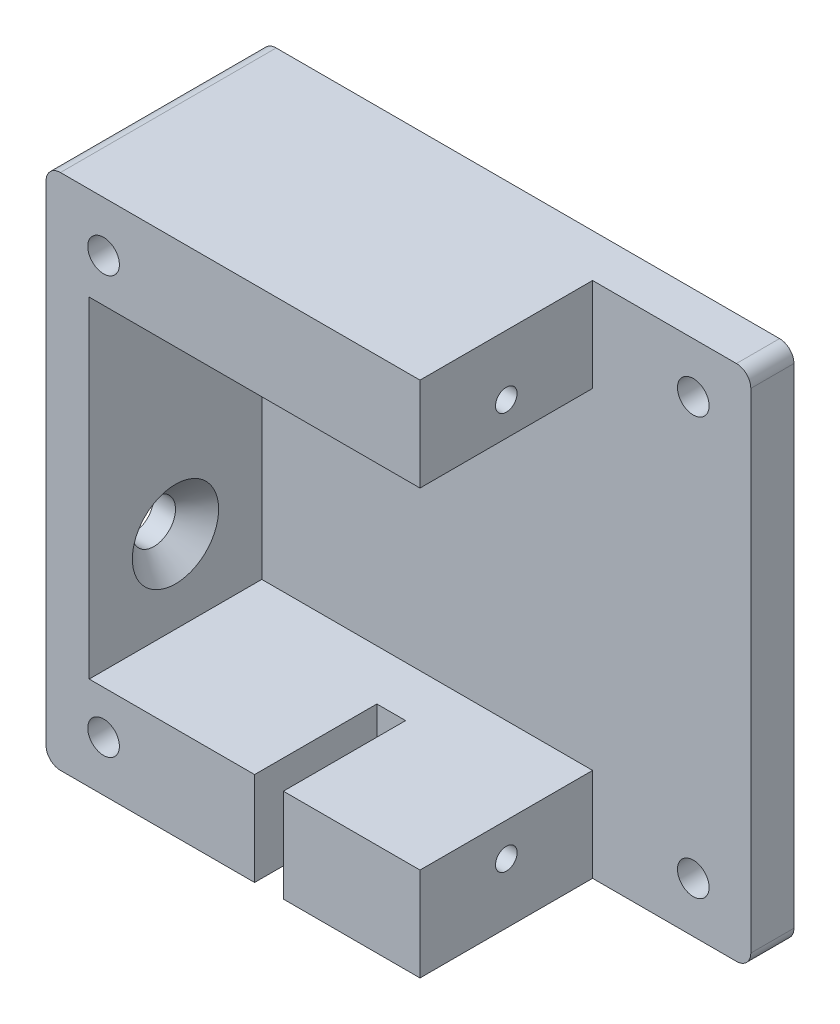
ISO-10303-21;
HEADER;
FILE_DESCRIPTION(('STEP AP214'),'2;1');
FILE_NAME('part.step','',(''),(''),'','','');
FILE_SCHEMA(('AUTOMOTIVE_DESIGN { 1 0 10303 214 1 1 1 1 }'));
ENDSEC;
DATA;
#1=APPLICATION_CONTEXT('core data for automotive mechanical design processes');
#2=APPLICATION_PROTOCOL_DEFINITION('international standard','automotive_design',2000,#1);
#3=PRODUCT_CONTEXT('',#1,'mechanical');
#4=PRODUCT('Part','Part','',(#3));
#5=PRODUCT_RELATED_PRODUCT_CATEGORY('part','',(#4));
#6=PRODUCT_DEFINITION_FORMATION('','',#4);
#7=PRODUCT_DEFINITION_CONTEXT('part definition',#1,'design');
#8=PRODUCT_DEFINITION('design','',#6,#7);
#9=PRODUCT_DEFINITION_SHAPE('','',#8);
#10=(LENGTH_UNIT() NAMED_UNIT(*) SI_UNIT(.MILLI.,.METRE.));
#11=(NAMED_UNIT(*) PLANE_ANGLE_UNIT() SI_UNIT($,.RADIAN.));
#12=(NAMED_UNIT(*) SI_UNIT($,.STERADIAN.) SOLID_ANGLE_UNIT());
#13=UNCERTAINTY_MEASURE_WITH_UNIT(LENGTH_MEASURE(1.E-05),#10,'distance_accuracy_value','');
#14=(GEOMETRIC_REPRESENTATION_CONTEXT(3) GLOBAL_UNCERTAINTY_ASSIGNED_CONTEXT((#13)) GLOBAL_UNIT_ASSIGNED_CONTEXT((#10,
#11,#12)) REPRESENTATION_CONTEXT('',''));
#15=CARTESIAN_POINT('',(0.,0.,0.));
#16=DIRECTION('',(0.,0.,1.));
#17=DIRECTION('',(1.,0.,0.));
#18=AXIS2_PLACEMENT_3D('',#15,#16,#17);
#19=CARTESIAN_POINT('',(0.,0.,15.));
#20=DIRECTION('',(0.,0.,1.));
#21=DIRECTION('',(1.,0.,0.));
#22=AXIS2_PLACEMENT_3D('',#19,#20,#21);
#23=PLANE('',#22);
#24=CARTESIAN_POINT('',(-14.5,14.5,15.));
#25=DIRECTION('',(0.,0.,-1.));
#26=DIRECTION('',(-1.,0.,0.));
#27=AXIS2_PLACEMENT_3D('',#24,#25,#26);
#28=CIRCLE('',#27,1.1);
#29=CARTESIAN_POINT('',(-15.6,14.5,15.));
#30=VERTEX_POINT('',#29);
#31=EDGE_CURVE('E402',#30,#30,#28,.T.);
#32=ORIENTED_EDGE('',*,*,#31,.T.);
#33=EDGE_LOOP('',(#32));
#34=FACE_BOUND('',#33,.T.);
#35=CARTESIAN_POINT('',(-14.5,-14.5,15.));
#36=DIRECTION('',(0.,0.,-1.));
#37=DIRECTION('',(-1.,0.,0.));
#38=AXIS2_PLACEMENT_3D('',#35,#36,#37);
#39=CIRCLE('',#38,1.1);
#40=CARTESIAN_POINT('',(-15.6,-14.5,15.));
#41=VERTEX_POINT('',#40);
#42=EDGE_CURVE('E409',#41,#41,#39,.T.);
#43=ORIENTED_EDGE('',*,*,#42,.T.);
#44=EDGE_LOOP('',(#43));
#45=FACE_BOUND('',#44,.T.);
#46=DIRECTION('',(0.,-1.,0.));
#47=VECTOR('',#46,1.);
#48=CARTESIAN_POINT('',(-18.5,18.,15.));
#49=LINE('',#48,#47);
#50=CARTESIAN_POINT('',(-18.5,17.,15.));
#51=VERTEX_POINT('',#50);
#52=CARTESIAN_POINT('',(-18.5,-17.,15.));
#53=VERTEX_POINT('',#52);
#54=EDGE_CURVE('E218',#51,#53,#49,.T.);
#55=ORIENTED_EDGE('',*,*,#54,.T.);
#56=CARTESIAN_POINT('',(-17.5,-17.,15.));
#57=DIRECTION('',(0.,0.,1.));
#58=DIRECTION('',(1.,0.,0.));
#59=AXIS2_PLACEMENT_3D('',#56,#57,#58);
#60=CIRCLE('',#59,1.);
#61=CARTESIAN_POINT('',(-17.5,-18.,15.));
#62=VERTEX_POINT('',#61);
#63=EDGE_CURVE('E11',#53,#62,#60,.T.);
#64=ORIENTED_EDGE('',*,*,#63,.T.);
#65=DIRECTION('',(1.,0.,0.));
#66=VECTOR('',#65,1.);
#67=CARTESIAN_POINT('',(-18.5,-18.,15.));
#68=LINE('',#67,#66);
#69=CARTESIAN_POINT('',(-4.,-18.,15.));
#70=VERTEX_POINT('',#69);
#71=EDGE_CURVE('E221',#62,#70,#68,.T.);
#72=ORIENTED_EDGE('',*,*,#71,.T.);
#73=DIRECTION('',(0.,-1.,0.));
#74=VECTOR('',#73,1.);
#75=CARTESIAN_POINT('',(-4.,-2.76787540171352,15.));
#76=LINE('',#75,#74);
#77=CARTESIAN_POINT('',(-4.,-11.5,15.));
#78=VERTEX_POINT('',#77);
#79=EDGE_CURVE('E178',#78,#70,#76,.T.);
#80=ORIENTED_EDGE('',*,*,#79,.F.);
#81=DIRECTION('',(-1.,0.,0.));
#82=VECTOR('',#81,1.);
#83=CARTESIAN_POINT('',(7.5,-11.5,15.));
#84=LINE('',#83,#82);
#85=CARTESIAN_POINT('',(-15.5,-11.5,15.));
#86=VERTEX_POINT('',#85);
#87=EDGE_CURVE('E225',#78,#86,#84,.T.);
#88=ORIENTED_EDGE('',*,*,#87,.T.);
#89=DIRECTION('',(0.,1.,0.));
#90=VECTOR('',#89,1.);
#91=CARTESIAN_POINT('',(-15.5,11.5,15.));
#92=LINE('',#91,#90);
#93=CARTESIAN_POINT('',(-15.5,11.5,15.));
#94=VERTEX_POINT('',#93);
#95=EDGE_CURVE('E229',#86,#94,#92,.T.);
#96=ORIENTED_EDGE('',*,*,#95,.T.);
#97=DIRECTION('',(1.,0.,0.));
#98=VECTOR('',#97,1.);
#99=CARTESIAN_POINT('',(-8.8,11.5,15.));
#100=LINE('',#99,#98);
#101=CARTESIAN_POINT('',(7.5,11.5,15.));
#102=VERTEX_POINT('',#101);
#103=EDGE_CURVE('E231',#94,#102,#100,.T.);
#104=ORIENTED_EDGE('',*,*,#103,.T.);
#105=DIRECTION('',(0.,1.,0.));
#106=VECTOR('',#105,1.);
#107=CARTESIAN_POINT('',(7.5,11.5,15.));
#108=LINE('',#107,#106);
#109=CARTESIAN_POINT('',(7.5,18.,15.));
#110=VERTEX_POINT('',#109);
#111=EDGE_CURVE('E212',#102,#110,#108,.T.);
#112=ORIENTED_EDGE('',*,*,#111,.T.);
#113=DIRECTION('',(-1.,0.,0.));
#114=VECTOR('',#113,1.);
#115=CARTESIAN_POINT('',(7.5,18.,15.));
#116=LINE('',#115,#114);
#117=CARTESIAN_POINT('',(-17.5,18.,15.));
#118=VERTEX_POINT('',#117);
#119=EDGE_CURVE('E215',#110,#118,#116,.T.);
#120=ORIENTED_EDGE('',*,*,#119,.T.);
#121=CARTESIAN_POINT('',(-17.5,17.,15.));
#122=DIRECTION('',(0.,0.,1.));
#123=DIRECTION('',(1.,0.,0.));
#124=AXIS2_PLACEMENT_3D('',#121,#122,#123);
#125=CIRCLE('',#124,1.);
#126=EDGE_CURVE('E42',#118,#51,#125,.T.);
#127=ORIENTED_EDGE('',*,*,#126,.T.);
#128=EDGE_LOOP('',(#55,#64,#72,#80,#88,#96,#104,#112,#120,#127));
#129=FACE_BOUND('',#128,.T.);
#130=ADVANCED_FACE('F34',(#34,#45,#129),#23,.T.);
#131=CARTESIAN_POINT('',(0.,0.,3.));
#132=DIRECTION('',(0.,0.,-1.));
#133=DIRECTION('',(-1.,0.,0.));
#134=AXIS2_PLACEMENT_3D('',#131,#132,#133);
#135=PLANE('',#134);
#136=CARTESIAN_POINT('',(14.5,-14.5,3.));
#137=DIRECTION('',(0.,0.,-1.));
#138=DIRECTION('',(-1.,0.,0.));
#139=AXIS2_PLACEMENT_3D('',#136,#137,#138);
#140=CIRCLE('',#139,1.1);
#141=CARTESIAN_POINT('',(13.4,-14.5,3.));
#142=VERTEX_POINT('',#141);
#143=EDGE_CURVE('E399',#142,#142,#140,.T.);
#144=ORIENTED_EDGE('',*,*,#143,.T.);
#145=EDGE_LOOP('',(#144));
#146=FACE_BOUND('',#145,.T.);
#147=CARTESIAN_POINT('',(14.5,14.5,3.));
#148=DIRECTION('',(0.,0.,-1.));
#149=DIRECTION('',(-1.,0.,0.));
#150=AXIS2_PLACEMENT_3D('',#147,#148,#149);
#151=CIRCLE('',#150,1.1);
#152=CARTESIAN_POINT('',(13.4,14.5,3.));
#153=VERTEX_POINT('',#152);
#154=EDGE_CURVE('E181',#153,#153,#151,.T.);
#155=ORIENTED_EDGE('',*,*,#154,.T.);
#156=EDGE_LOOP('',(#155));
#157=FACE_BOUND('',#156,.T.);
#158=DIRECTION('',(0.,1.,0.));
#159=VECTOR('',#158,1.);
#160=CARTESIAN_POINT('',(18.5,-18.,3.));
#161=LINE('',#160,#159);
#162=CARTESIAN_POINT('',(18.5,-17.,3.));
#163=VERTEX_POINT('',#162);
#164=CARTESIAN_POINT('',(18.5,17.,3.));
#165=VERTEX_POINT('',#164);
#166=EDGE_CURVE('E265',#163,#165,#161,.T.);
#167=ORIENTED_EDGE('',*,*,#166,.T.);
#168=CARTESIAN_POINT('',(17.5,17.,3.));
#169=DIRECTION('',(0.,0.,-1.));
#170=DIRECTION('',(-1.,0.,0.));
#171=AXIS2_PLACEMENT_3D('',#168,#169,#170);
#172=CIRCLE('',#171,1.);
#173=CARTESIAN_POINT('',(17.5,18.,3.));
#174=VERTEX_POINT('',#173);
#175=EDGE_CURVE('E310',#165,#174,#172,.F.);
#176=ORIENTED_EDGE('',*,*,#175,.T.);
#177=DIRECTION('',(-1.,0.,0.));
#178=VECTOR('',#177,1.);
#179=CARTESIAN_POINT('',(-18.5,18.,3.));
#180=LINE('',#179,#178);
#181=CARTESIAN_POINT('',(7.5,18.,3.));
#182=VERTEX_POINT('',#181);
#183=EDGE_CURVE('E268',#174,#182,#180,.T.);
#184=ORIENTED_EDGE('',*,*,#183,.T.);
#185=DIRECTION('',(0.,1.,0.));
#186=VECTOR('',#185,1.);
#187=CARTESIAN_POINT('',(7.5,11.5,3.));
#188=LINE('',#187,#186);
#189=CARTESIAN_POINT('',(7.5,11.5,3.));
#190=VERTEX_POINT('',#189);
#191=EDGE_CURVE('E211',#190,#182,#188,.T.);
#192=ORIENTED_EDGE('',*,*,#191,.F.);
#193=DIRECTION('',(1.,0.,0.));
#194=VECTOR('',#193,1.);
#195=CARTESIAN_POINT('',(-8.8,11.5,3.));
#196=LINE('',#195,#194);
#197=CARTESIAN_POINT('',(-15.5,11.5,3.));
#198=VERTEX_POINT('',#197);
#199=EDGE_CURVE('E216',#198,#190,#196,.T.);
#200=ORIENTED_EDGE('',*,*,#199,.F.);
#201=DIRECTION('',(0.,1.,0.));
#202=VECTOR('',#201,1.);
#203=CARTESIAN_POINT('',(-15.5,11.5,3.));
#204=LINE('',#203,#202);
#205=CARTESIAN_POINT('',(-15.5,-11.5,3.));
#206=VERTEX_POINT('',#205);
#207=EDGE_CURVE('E242',#206,#198,#204,.T.);
#208=ORIENTED_EDGE('',*,*,#207,.F.);
#209=DIRECTION('',(-1.,0.,0.));
#210=VECTOR('',#209,1.);
#211=CARTESIAN_POINT('',(-15.5,-11.5,3.));
#212=LINE('',#211,#210);
#213=CARTESIAN_POINT('',(7.5,-11.5,3.));
#214=VERTEX_POINT('',#213);
#215=EDGE_CURVE('E239',#214,#206,#212,.T.);
#216=ORIENTED_EDGE('',*,*,#215,.F.);
#217=DIRECTION('',(0.,1.,0.));
#218=VECTOR('',#217,1.);
#219=CARTESIAN_POINT('',(7.5,-18.,3.));
#220=LINE('',#219,#218);
#221=CARTESIAN_POINT('',(7.5,-18.,3.));
#222=VERTEX_POINT('',#221);
#223=EDGE_CURVE('E236',#222,#214,#220,.T.);
#224=ORIENTED_EDGE('',*,*,#223,.F.);
#225=DIRECTION('',(1.,0.,0.));
#226=VECTOR('',#225,1.);
#227=CARTESIAN_POINT('',(-18.5,-18.,3.));
#228=LINE('',#227,#226);
#229=CARTESIAN_POINT('',(17.5,-18.,3.));
#230=VERTEX_POINT('',#229);
#231=EDGE_CURVE('E271',#222,#230,#228,.T.);
#232=ORIENTED_EDGE('',*,*,#231,.T.);
#233=CARTESIAN_POINT('',(17.5,-17.,3.));
#234=DIRECTION('',(0.,0.,-1.));
#235=DIRECTION('',(-1.,0.,0.));
#236=AXIS2_PLACEMENT_3D('',#233,#234,#235);
#237=CIRCLE('',#236,1.);
#238=EDGE_CURVE('E308',#230,#163,#237,.F.);
#239=ORIENTED_EDGE('',*,*,#238,.T.);
#240=EDGE_LOOP('',(#167,#176,#184,#192,#200,#208,#216,#224,#232,#239));
#241=FACE_BOUND('',#240,.T.);
#242=ADVANCED_FACE('F360',(#146,#157,#241),#135,.F.);
#243=CARTESIAN_POINT('',(18.5,-18.,3.));
#244=DIRECTION('',(-1.,0.,0.));
#245=DIRECTION('',(0.,0.,1.));
#246=AXIS2_PLACEMENT_3D('',#243,#244,#245);
#247=PLANE('',#246);
#248=DIRECTION('',(0.,1.,0.));
#249=VECTOR('',#248,1.);
#250=CARTESIAN_POINT('',(18.5,-18.,0.));
#251=LINE('',#250,#249);
#252=CARTESIAN_POINT('',(18.5,-17.,0.));
#253=VERTEX_POINT('',#252);
#254=CARTESIAN_POINT('',(18.5,17.,0.));
#255=VERTEX_POINT('',#254);
#256=EDGE_CURVE('E264',#253,#255,#251,.T.);
#257=ORIENTED_EDGE('',*,*,#256,.T.);
#258=DIRECTION('',(0.,0.,-1.));
#259=VECTOR('',#258,1.);
#260=CARTESIAN_POINT('',(18.5,17.,3.));
#261=LINE('',#260,#259);
#262=EDGE_CURVE('E306',#255,#165,#261,.F.);
#263=ORIENTED_EDGE('',*,*,#262,.T.);
#264=ORIENTED_EDGE('',*,*,#166,.F.);
#265=DIRECTION('',(0.,0.,-1.));
#266=VECTOR('',#265,1.);
#267=CARTESIAN_POINT('',(18.5,-17.,3.));
#268=LINE('',#267,#266);
#269=EDGE_CURVE('E303',#163,#253,#268,.T.);
#270=ORIENTED_EDGE('',*,*,#269,.T.);
#271=EDGE_LOOP('',(#257,#263,#264,#270));
#272=FACE_BOUND('',#271,.T.);
#273=ADVANCED_FACE('F367',(#272),#247,.F.);
#274=CARTESIAN_POINT('',(-18.5,18.,3.));
#275=DIRECTION('',(0.,-1.,0.));
#276=DIRECTION('',(0.,0.,-1.));
#277=AXIS2_PLACEMENT_3D('',#274,#275,#276);
#278=PLANE('',#277);
#279=ORIENTED_EDGE('',*,*,#183,.F.);
#280=DIRECTION('',(0.,0.,-1.));
#281=VECTOR('',#280,1.);
#282=CARTESIAN_POINT('',(17.5,18.,3.));
#283=LINE('',#282,#281);
#284=CARTESIAN_POINT('',(17.5,18.,0.));
#285=VERTEX_POINT('',#284);
#286=EDGE_CURVE('E292',#174,#285,#283,.T.);
#287=ORIENTED_EDGE('',*,*,#286,.T.);
#288=DIRECTION('',(-1.,0.,0.));
#289=VECTOR('',#288,1.);
#290=CARTESIAN_POINT('',(-18.5,18.,0.));
#291=LINE('',#290,#289);
#292=CARTESIAN_POINT('',(-17.5,18.,0.));
#293=VERTEX_POINT('',#292);
#294=EDGE_CURVE('E277',#285,#293,#291,.T.);
#295=ORIENTED_EDGE('',*,*,#294,.T.);
#296=DIRECTION('',(0.,0.,-1.));
#297=VECTOR('',#296,1.);
#298=CARTESIAN_POINT('',(-17.5,18.,3.));
#299=LINE('',#298,#297);
#300=EDGE_CURVE('E288',#293,#118,#299,.F.);
#301=ORIENTED_EDGE('',*,*,#300,.T.);
#302=ORIENTED_EDGE('',*,*,#119,.F.);
#303=DIRECTION('',(0.,0.,-1.));
#304=VECTOR('',#303,1.);
#305=CARTESIAN_POINT('',(7.5,18.,15.));
#306=LINE('',#305,#304);
#307=EDGE_CURVE('E261',#110,#182,#306,.T.);
#308=ORIENTED_EDGE('',*,*,#307,.T.);
#309=EDGE_LOOP('',(#279,#287,#295,#301,#302,#308));
#310=FACE_BOUND('',#309,.T.);
#311=ADVANCED_FACE('F351',(#310),#278,.F.);
#312=CARTESIAN_POINT('',(-18.5,-18.,3.));
#313=DIRECTION('',(1.,0.,0.));
#314=DIRECTION('',(0.,0.,-1.));
#315=AXIS2_PLACEMENT_3D('',#312,#313,#314);
#316=PLANE('',#315);
#317=CARTESIAN_POINT('',(-18.5,-5.77,9.));
#318=DIRECTION('',(1.,0.,0.));
#319=DIRECTION('',(0.,1.,0.));
#320=AXIS2_PLACEMENT_3D('',#317,#318,#319);
#321=CIRCLE('',#320,1.5);
#322=CARTESIAN_POINT('',(-18.5,-4.27,9.));
#323=VERTEX_POINT('',#322);
#324=EDGE_CURVE('E206',#323,#323,#321,.T.);
#325=ORIENTED_EDGE('',*,*,#324,.T.);
#326=EDGE_LOOP('',(#325));
#327=FACE_BOUND('',#326,.T.);
#328=DIRECTION('',(0.,-1.,0.));
#329=VECTOR('',#328,1.);
#330=CARTESIAN_POINT('',(-18.5,-18.,0.));
#331=LINE('',#330,#329);
#332=CARTESIAN_POINT('',(-18.5,17.,0.));
#333=VERTEX_POINT('',#332);
#334=CARTESIAN_POINT('',(-18.5,-17.,0.));
#335=VERTEX_POINT('',#334);
#336=EDGE_CURVE('E280',#333,#335,#331,.T.);
#337=ORIENTED_EDGE('',*,*,#336,.T.);
#338=DIRECTION('',(0.,0.,-1.));
#339=VECTOR('',#338,1.);
#340=CARTESIAN_POINT('',(-18.5,-17.,3.));
#341=LINE('',#340,#339);
#342=EDGE_CURVE('E49',#335,#53,#341,.F.);
#343=ORIENTED_EDGE('',*,*,#342,.T.);
#344=ORIENTED_EDGE('',*,*,#54,.F.);
#345=DIRECTION('',(0.,0.,-1.));
#346=VECTOR('',#345,1.);
#347=CARTESIAN_POINT('',(-18.5,17.,3.));
#348=LINE('',#347,#346);
#349=EDGE_CURVE('E317',#51,#333,#348,.T.);
#350=ORIENTED_EDGE('',*,*,#349,.T.);
#351=EDGE_LOOP('',(#337,#343,#344,#350));
#352=FACE_BOUND('',#351,.T.);
#353=ADVANCED_FACE('F322',(#327,#352),#316,.F.);
#354=CARTESIAN_POINT('',(-18.5,-18.,3.));
#355=DIRECTION('',(0.,1.,0.));
#356=DIRECTION('',(0.,0.,1.));
#357=AXIS2_PLACEMENT_3D('',#354,#355,#356);
#358=PLANE('',#357);
#359=DIRECTION('',(1.,0.,0.));
#360=VECTOR('',#359,1.);
#361=CARTESIAN_POINT('',(-18.5,-18.,0.));
#362=LINE('',#361,#360);
#363=CARTESIAN_POINT('',(-17.5,-18.,0.));
#364=VERTEX_POINT('',#363);
#365=CARTESIAN_POINT('',(17.5,-18.,0.));
#366=VERTEX_POINT('',#365);
#367=EDGE_CURVE('E269',#364,#366,#362,.T.);
#368=ORIENTED_EDGE('',*,*,#367,.T.);
#369=DIRECTION('',(0.,0.,-1.));
#370=VECTOR('',#369,1.);
#371=CARTESIAN_POINT('',(17.5,-18.,3.));
#372=LINE('',#371,#370);
#373=EDGE_CURVE('E315',#366,#230,#372,.F.);
#374=ORIENTED_EDGE('',*,*,#373,.T.);
#375=ORIENTED_EDGE('',*,*,#231,.F.);
#376=DIRECTION('',(0.,0.,-1.));
#377=VECTOR('',#376,1.);
#378=CARTESIAN_POINT('',(7.5,-18.,15.));
#379=LINE('',#378,#377);
#380=CARTESIAN_POINT('',(7.5,-18.,15.));
#381=VERTEX_POINT('',#380);
#382=EDGE_CURVE('E258',#381,#222,#379,.T.);
#383=ORIENTED_EDGE('',*,*,#382,.F.);
#384=CARTESIAN_POINT('',(-2.00000000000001,-18.,15.));
#385=VERTEX_POINT('',#384);
#386=EDGE_CURVE('E220',#385,#381,#68,.T.);
#387=ORIENTED_EDGE('',*,*,#386,.F.);
#388=DIRECTION('',(0.,0.,1.));
#389=VECTOR('',#388,1.);
#390=CARTESIAN_POINT('',(-2.,-18.,15.));
#391=LINE('',#390,#389);
#392=CARTESIAN_POINT('',(-2.,-18.,6.5));
#393=VERTEX_POINT('',#392);
#394=EDGE_CURVE('E171',#393,#385,#391,.T.);
#395=ORIENTED_EDGE('',*,*,#394,.F.);
#396=DIRECTION('',(1.,0.,0.));
#397=VECTOR('',#396,1.);
#398=CARTESIAN_POINT('',(-4.,-18.,6.5));
#399=LINE('',#398,#397);
#400=CARTESIAN_POINT('',(-4.,-18.,6.5));
#401=VERTEX_POINT('',#400);
#402=EDGE_CURVE('E164',#401,#393,#399,.T.);
#403=ORIENTED_EDGE('',*,*,#402,.F.);
#404=DIRECTION('',(0.,0.,-1.));
#405=VECTOR('',#404,1.);
#406=CARTESIAN_POINT('',(-4.,-18.,15.));
#407=LINE('',#406,#405);
#408=EDGE_CURVE('E175',#70,#401,#407,.T.);
#409=ORIENTED_EDGE('',*,*,#408,.F.);
#410=ORIENTED_EDGE('',*,*,#71,.F.);
#411=DIRECTION('',(0.,0.,-1.));
#412=VECTOR('',#411,1.);
#413=CARTESIAN_POINT('',(-17.5,-18.,3.));
#414=LINE('',#413,#412);
#415=EDGE_CURVE('E312',#62,#364,#414,.T.);
#416=ORIENTED_EDGE('',*,*,#415,.T.);
#417=EDGE_LOOP('',(#368,#374,#375,#383,#387,#395,#403,#409,#410,#416));
#418=FACE_BOUND('',#417,.T.);
#419=ADVANCED_FACE('F184',(#418),#358,.F.);
#420=CARTESIAN_POINT('',(0.,0.,0.));
#421=DIRECTION('',(0.,0.,-1.));
#422=DIRECTION('',(-1.,0.,0.));
#423=AXIS2_PLACEMENT_3D('',#420,#421,#422);
#424=PLANE('',#423);
#425=CARTESIAN_POINT('',(-14.5,14.5,0.));
#426=DIRECTION('',(0.,0.,-1.));
#427=DIRECTION('',(-1.,0.,0.));
#428=AXIS2_PLACEMENT_3D('',#425,#426,#427);
#429=CIRCLE('',#428,1.1);
#430=CARTESIAN_POINT('',(-15.6,14.5,0.));
#431=VERTEX_POINT('',#430);
#432=EDGE_CURVE('E412',#431,#431,#429,.T.);
#433=ORIENTED_EDGE('',*,*,#432,.F.);
#434=EDGE_LOOP('',(#433));
#435=FACE_BOUND('',#434,.T.);
#436=CARTESIAN_POINT('',(-14.5,-14.5,0.));
#437=DIRECTION('',(0.,0.,-1.));
#438=DIRECTION('',(-1.,0.,0.));
#439=AXIS2_PLACEMENT_3D('',#436,#437,#438);
#440=CIRCLE('',#439,1.1);
#441=CARTESIAN_POINT('',(-15.6,-14.5,0.));
#442=VERTEX_POINT('',#441);
#443=EDGE_CURVE('E406',#442,#442,#440,.T.);
#444=ORIENTED_EDGE('',*,*,#443,.F.);
#445=EDGE_LOOP('',(#444));
#446=FACE_BOUND('',#445,.T.);
#447=CARTESIAN_POINT('',(14.5,-14.5,0.));
#448=DIRECTION('',(0.,0.,-1.));
#449=DIRECTION('',(-1.,0.,0.));
#450=AXIS2_PLACEMENT_3D('',#447,#448,#449);
#451=CIRCLE('',#450,1.1);
#452=CARTESIAN_POINT('',(13.4,-14.5,0.));
#453=VERTEX_POINT('',#452);
#454=EDGE_CURVE('E403',#453,#453,#451,.T.);
#455=ORIENTED_EDGE('',*,*,#454,.F.);
#456=EDGE_LOOP('',(#455));
#457=FACE_BOUND('',#456,.T.);
#458=CARTESIAN_POINT('',(14.5,14.5,0.));
#459=DIRECTION('',(0.,0.,-1.));
#460=DIRECTION('',(-1.,0.,0.));
#461=AXIS2_PLACEMENT_3D('',#458,#459,#460);
#462=CIRCLE('',#461,1.1);
#463=CARTESIAN_POINT('',(13.4,14.5,0.));
#464=VERTEX_POINT('',#463);
#465=EDGE_CURVE('E396',#464,#464,#462,.T.);
#466=ORIENTED_EDGE('',*,*,#465,.F.);
#467=EDGE_LOOP('',(#466));
#468=FACE_BOUND('',#467,.T.);
#469=ORIENTED_EDGE('',*,*,#294,.F.);
#470=CARTESIAN_POINT('',(17.5,17.,0.));
#471=DIRECTION('',(0.,0.,-1.));
#472=DIRECTION('',(-1.,0.,0.));
#473=AXIS2_PLACEMENT_3D('',#470,#471,#472);
#474=CIRCLE('',#473,1.);
#475=EDGE_CURVE('E301',#285,#255,#474,.T.);
#476=ORIENTED_EDGE('',*,*,#475,.T.);
#477=ORIENTED_EDGE('',*,*,#256,.F.);
#478=CARTESIAN_POINT('',(17.5,-17.,0.));
#479=DIRECTION('',(0.,0.,-1.));
#480=DIRECTION('',(-1.,0.,0.));
#481=AXIS2_PLACEMENT_3D('',#478,#479,#480);
#482=CIRCLE('',#481,1.);
#483=EDGE_CURVE('E299',#253,#366,#482,.T.);
#484=ORIENTED_EDGE('',*,*,#483,.T.);
#485=ORIENTED_EDGE('',*,*,#367,.F.);
#486=CARTESIAN_POINT('',(-17.5,-17.,0.));
#487=DIRECTION('',(0.,0.,-1.));
#488=DIRECTION('',(-1.,0.,0.));
#489=AXIS2_PLACEMENT_3D('',#486,#487,#488);
#490=CIRCLE('',#489,1.);
#491=EDGE_CURVE('E297',#364,#335,#490,.T.);
#492=ORIENTED_EDGE('',*,*,#491,.T.);
#493=ORIENTED_EDGE('',*,*,#336,.F.);
#494=CARTESIAN_POINT('',(-17.5,17.,0.));
#495=DIRECTION('',(0.,0.,-1.));
#496=DIRECTION('',(-1.,0.,0.));
#497=AXIS2_PLACEMENT_3D('',#494,#495,#496);
#498=CIRCLE('',#497,1.);
#499=EDGE_CURVE('E295',#333,#293,#498,.T.);
#500=ORIENTED_EDGE('',*,*,#499,.T.);
#501=EDGE_LOOP('',(#469,#476,#477,#484,#485,#492,#493,#500));
#502=FACE_BOUND('',#501,.T.);
#503=ADVANCED_FACE('F326',(#435,#446,#457,#468,#502),#424,.T.);
#504=CARTESIAN_POINT('',(7.5,11.5,15.));
#505=DIRECTION('',(-1.,0.,0.));
#506=DIRECTION('',(0.,0.,1.));
#507=AXIS2_PLACEMENT_3D('',#504,#505,#506);
#508=PLANE('',#507);
#509=CARTESIAN_POINT('',(7.5,13.82,9.));
#510=DIRECTION('',(1.,0.,0.));
#511=DIRECTION('',(0.,0.,-1.));
#512=AXIS2_PLACEMENT_3D('',#509,#510,#511);
#513=CIRCLE('',#512,0.75);
#514=CARTESIAN_POINT('',(7.5,13.82,8.25));
#515=VERTEX_POINT('',#514);
#516=EDGE_CURVE('E202',#515,#515,#513,.T.);
#517=ORIENTED_EDGE('',*,*,#516,.F.);
#518=EDGE_LOOP('',(#517));
#519=FACE_BOUND('',#518,.T.);
#520=ORIENTED_EDGE('',*,*,#191,.T.);
#521=ORIENTED_EDGE('',*,*,#307,.F.);
#522=ORIENTED_EDGE('',*,*,#111,.F.);
#523=DIRECTION('',(0.,0.,-1.));
#524=VECTOR('',#523,1.);
#525=CARTESIAN_POINT('',(7.5,11.5,15.));
#526=LINE('',#525,#524);
#527=EDGE_CURVE('E233',#102,#190,#526,.T.);
#528=ORIENTED_EDGE('',*,*,#527,.T.);
#529=EDGE_LOOP('',(#520,#521,#522,#528));
#530=FACE_BOUND('',#529,.T.);
#531=ADVANCED_FACE('F348',(#519,#530),#508,.F.);
#532=CARTESIAN_POINT('',(7.5,-18.,15.));
#533=DIRECTION('',(-1.,0.,0.));
#534=DIRECTION('',(0.,0.,1.));
#535=AXIS2_PLACEMENT_3D('',#532,#533,#534);
#536=PLANE('',#535);
#537=CARTESIAN_POINT('',(7.5,-13.82,9.));
#538=DIRECTION('',(-1.,0.,0.));
#539=DIRECTION('',(0.,0.,-1.));
#540=AXIS2_PLACEMENT_3D('',#537,#538,#539);
#541=CIRCLE('',#540,0.75);
#542=CARTESIAN_POINT('',(7.5,-13.82,8.25));
#543=VERTEX_POINT('',#542);
#544=EDGE_CURVE('E199',#543,#543,#541,.T.);
#545=ORIENTED_EDGE('',*,*,#544,.T.);
#546=EDGE_LOOP('',(#545));
#547=FACE_BOUND('',#546,.T.);
#548=ORIENTED_EDGE('',*,*,#223,.T.);
#549=DIRECTION('',(0.,0.,-1.));
#550=VECTOR('',#549,1.);
#551=CARTESIAN_POINT('',(7.5,-11.5,15.));
#552=LINE('',#551,#550);
#553=CARTESIAN_POINT('',(7.5,-11.5,15.));
#554=VERTEX_POINT('',#553);
#555=EDGE_CURVE('E255',#554,#214,#552,.T.);
#556=ORIENTED_EDGE('',*,*,#555,.F.);
#557=DIRECTION('',(0.,1.,0.));
#558=VECTOR('',#557,1.);
#559=CARTESIAN_POINT('',(7.5,-18.,15.));
#560=LINE('',#559,#558);
#561=EDGE_CURVE('E223',#381,#554,#560,.T.);
#562=ORIENTED_EDGE('',*,*,#561,.F.);
#563=ORIENTED_EDGE('',*,*,#382,.T.);
#564=EDGE_LOOP('',(#548,#556,#562,#563));
#565=FACE_BOUND('',#564,.T.);
#566=ADVANCED_FACE('F391',(#547,#565),#536,.F.);
#567=CARTESIAN_POINT('',(-15.5,-11.5,15.));
#568=DIRECTION('',(0.,-1.,0.));
#569=DIRECTION('',(0.,0.,-1.));
#570=AXIS2_PLACEMENT_3D('',#567,#568,#569);
#571=PLANE('',#570);
#572=ORIENTED_EDGE('',*,*,#87,.F.);
#573=DIRECTION('',(0.,0.,1.));
#574=VECTOR('',#573,1.);
#575=CARTESIAN_POINT('',(-4.,-11.5,15.));
#576=LINE('',#575,#574);
#577=CARTESIAN_POINT('',(-4.,-11.5,6.5));
#578=VERTEX_POINT('',#577);
#579=EDGE_CURVE('E198',#578,#78,#576,.T.);
#580=ORIENTED_EDGE('',*,*,#579,.F.);
#581=DIRECTION('',(-1.,0.,0.));
#582=VECTOR('',#581,1.);
#583=CARTESIAN_POINT('',(-4.,-11.5,6.5));
#584=LINE('',#583,#582);
#585=CARTESIAN_POINT('',(-2.,-11.5,6.5));
#586=VERTEX_POINT('',#585);
#587=EDGE_CURVE('E167',#586,#578,#584,.T.);
#588=ORIENTED_EDGE('',*,*,#587,.F.);
#589=DIRECTION('',(0.,0.,-1.));
#590=VECTOR('',#589,1.);
#591=CARTESIAN_POINT('',(-2.,-11.5,15.));
#592=LINE('',#591,#590);
#593=CARTESIAN_POINT('',(-2.,-11.5,15.));
#594=VERTEX_POINT('',#593);
#595=EDGE_CURVE('E191',#594,#586,#592,.T.);
#596=ORIENTED_EDGE('',*,*,#595,.F.);
#597=EDGE_CURVE('E226',#554,#594,#84,.T.);
#598=ORIENTED_EDGE('',*,*,#597,.F.);
#599=ORIENTED_EDGE('',*,*,#555,.T.);
#600=ORIENTED_EDGE('',*,*,#215,.T.);
#601=DIRECTION('',(0.,0.,-1.));
#602=VECTOR('',#601,1.);
#603=CARTESIAN_POINT('',(-15.5,-11.5,15.));
#604=LINE('',#603,#602);
#605=EDGE_CURVE('E252',#86,#206,#604,.T.);
#606=ORIENTED_EDGE('',*,*,#605,.F.);
#607=EDGE_LOOP('',(#572,#580,#588,#596,#598,#599,#600,#606));
#608=FACE_BOUND('',#607,.T.);
#609=ADVANCED_FACE('F336',(#608),#571,.F.);
#610=CARTESIAN_POINT('',(-15.5,11.5,15.));
#611=DIRECTION('',(-1.,0.,0.));
#612=DIRECTION('',(0.,-1.,0.));
#613=AXIS2_PLACEMENT_3D('',#610,#611,#612);
#614=PLANE('',#613);
#615=CARTESIAN_POINT('',(-15.5,-5.77,9.));
#616=DIRECTION('',(-1.,0.,0.));
#617=DIRECTION('',(0.,-1.,0.));
#618=AXIS2_PLACEMENT_3D('',#615,#616,#617);
#619=CIRCLE('',#618,3.);
#620=CARTESIAN_POINT('',(-15.5,-8.77,9.));
#621=VERTEX_POINT('',#620);
#622=EDGE_CURVE('E285',#621,#621,#619,.T.);
#623=ORIENTED_EDGE('',*,*,#622,.T.);
#624=EDGE_LOOP('',(#623));
#625=FACE_BOUND('',#624,.T.);
#626=ORIENTED_EDGE('',*,*,#207,.T.);
#627=DIRECTION('',(0.,0.,-1.));
#628=VECTOR('',#627,1.);
#629=CARTESIAN_POINT('',(-15.5,11.5,15.));
#630=LINE('',#629,#628);
#631=EDGE_CURVE('E249',#94,#198,#630,.T.);
#632=ORIENTED_EDGE('',*,*,#631,.F.);
#633=ORIENTED_EDGE('',*,*,#95,.F.);
#634=ORIENTED_EDGE('',*,*,#605,.T.);
#635=EDGE_LOOP('',(#626,#632,#633,#634));
#636=FACE_BOUND('',#635,.T.);
#637=ADVANCED_FACE('F340',(#625,#636),#614,.F.);
#638=CARTESIAN_POINT('',(-8.8,11.5,15.));
#639=DIRECTION('',(0.,1.,0.));
#640=DIRECTION('',(0.,0.,1.));
#641=AXIS2_PLACEMENT_3D('',#638,#639,#640);
#642=PLANE('',#641);
#643=ORIENTED_EDGE('',*,*,#199,.T.);
#644=ORIENTED_EDGE('',*,*,#527,.F.);
#645=ORIENTED_EDGE('',*,*,#103,.F.);
#646=ORIENTED_EDGE('',*,*,#631,.T.);
#647=EDGE_LOOP('',(#643,#644,#645,#646));
#648=FACE_BOUND('',#647,.T.);
#649=ADVANCED_FACE('F346',(#648),#642,.F.);
#650=DIRECTION('',(0.,-1.,0.));
#651=VECTOR('',#650,1.);
#652=CARTESIAN_POINT('',(-2.,-2.76787540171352,15.));
#653=LINE('',#652,#651);
#654=EDGE_CURVE('E192',#594,#385,#653,.T.);
#655=ORIENTED_EDGE('',*,*,#654,.T.);
#656=ORIENTED_EDGE('',*,*,#386,.T.);
#657=ORIENTED_EDGE('',*,*,#561,.T.);
#658=ORIENTED_EDGE('',*,*,#597,.T.);
#659=EDGE_LOOP('',(#655,#656,#657,#658));
#660=FACE_BOUND('',#659,.T.);
#661=ADVANCED_FACE('F363',(#660),#23,.T.);
#662=CARTESIAN_POINT('',(-18.5,-5.77,9.));
#663=DIRECTION('',(1.,0.,0.));
#664=DIRECTION('',(0.,1.,0.));
#665=AXIS2_PLACEMENT_3D('',#662,#663,#664);
#666=CYLINDRICAL_SURFACE('',#665,1.5);
#667=CARTESIAN_POINT('',(-17.,-5.77,9.));
#668=DIRECTION('',(-1.,0.,0.));
#669=DIRECTION('',(0.,0.,1.));
#670=AXIS2_PLACEMENT_3D('',#667,#668,#669);
#671=CIRCLE('',#670,1.5);
#672=CARTESIAN_POINT('',(-17.,-5.77,10.5));
#673=VERTEX_POINT('',#672);
#674=EDGE_CURVE('E274',#673,#673,#671,.F.);
#675=ORIENTED_EDGE('',*,*,#674,.T.);
#676=EDGE_LOOP('',(#675));
#677=FACE_BOUND('',#676,.T.);
#678=ORIENTED_EDGE('',*,*,#324,.F.);
#679=EDGE_LOOP('',(#678));
#680=FACE_BOUND('',#679,.T.);
#681=ADVANCED_FACE('F375',(#677,#680),#666,.F.);
#682=CARTESIAN_POINT('',(-17.,-5.77,9.));
#683=DIRECTION('',(1.,0.,0.));
#684=DIRECTION('',(0.,0.,-1.));
#685=AXIS2_PLACEMENT_3D('',#682,#683,#684);
#686=CONICAL_SURFACE('',#685,1.5,0.785398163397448);
#687=ORIENTED_EDGE('',*,*,#622,.F.);
#688=EDGE_LOOP('',(#687));
#689=FACE_BOUND('',#688,.T.);
#690=ORIENTED_EDGE('',*,*,#674,.F.);
#691=EDGE_LOOP('',(#690));
#692=FACE_BOUND('',#691,.T.);
#693=ADVANCED_FACE('F381',(#689,#692),#686,.F.);
#694=CARTESIAN_POINT('',(-2.5,13.82,9.));
#695=DIRECTION('',(1.,0.,0.));
#696=DIRECTION('',(0.,0.,-1.));
#697=AXIS2_PLACEMENT_3D('',#694,#695,#696);
#698=CYLINDRICAL_SURFACE('',#697,0.75);
#699=CARTESIAN_POINT('',(-2.5,13.82,9.));
#700=DIRECTION('',(1.,0.,0.));
#701=DIRECTION('',(0.,0.,-1.));
#702=AXIS2_PLACEMENT_3D('',#699,#700,#701);
#703=CIRCLE('',#702,0.75);
#704=CARTESIAN_POINT('',(-2.5,13.82,8.25));
#705=VERTEX_POINT('',#704);
#706=EDGE_CURVE('E203',#705,#705,#703,.T.);
#707=ORIENTED_EDGE('',*,*,#706,.F.);
#708=EDGE_LOOP('',(#707));
#709=FACE_BOUND('',#708,.T.);
#710=ORIENTED_EDGE('',*,*,#516,.T.);
#711=EDGE_LOOP('',(#710));
#712=FACE_BOUND('',#711,.T.);
#713=ADVANCED_FACE('F460',(#709,#712),#698,.F.);
#714=CARTESIAN_POINT('',(-2.5,13.82,9.));
#715=DIRECTION('',(1.,0.,0.));
#716=DIRECTION('',(0.,0.,-1.));
#717=AXIS2_PLACEMENT_3D('',#714,#715,#716);
#718=PLANE('',#717);
#719=ORIENTED_EDGE('',*,*,#706,.T.);
#720=EDGE_LOOP('',(#719));
#721=FACE_BOUND('',#720,.T.);
#722=ADVANCED_FACE('F523',(#721),#718,.T.);
#723=CARTESIAN_POINT('',(-2.5,-13.82,9.));
#724=DIRECTION('',(1.,0.,0.));
#725=DIRECTION('',(0.,0.,-1.));
#726=AXIS2_PLACEMENT_3D('',#723,#724,#725);
#727=CYLINDRICAL_SURFACE('',#726,0.75);
#728=CARTESIAN_POINT('',(-2.,-13.82,9.));
#729=DIRECTION('',(1.,0.,0.));
#730=DIRECTION('',(0.,0.,-1.));
#731=AXIS2_PLACEMENT_3D('',#728,#729,#730);
#732=CIRCLE('',#731,0.75);
#733=CARTESIAN_POINT('',(-2.,-13.82,8.25));
#734=VERTEX_POINT('',#733);
#735=EDGE_CURVE('E197',#734,#734,#732,.T.);
#736=ORIENTED_EDGE('',*,*,#735,.F.);
#737=EDGE_LOOP('',(#736));
#738=FACE_BOUND('',#737,.T.);
#739=ORIENTED_EDGE('',*,*,#544,.F.);
#740=EDGE_LOOP('',(#739));
#741=FACE_BOUND('',#740,.T.);
#742=ADVANCED_FACE('F532',(#738,#741),#727,.F.);
#743=CARTESIAN_POINT('',(-4.,-2.76787540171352,15.));
#744=DIRECTION('',(-1.,0.,0.));
#745=DIRECTION('',(0.,0.,1.));
#746=AXIS2_PLACEMENT_3D('',#743,#744,#745);
#747=PLANE('',#746);
#748=ORIENTED_EDGE('',*,*,#579,.T.);
#749=ORIENTED_EDGE('',*,*,#79,.T.);
#750=ORIENTED_EDGE('',*,*,#408,.T.);
#751=DIRECTION('',(0.,-1.,0.));
#752=VECTOR('',#751,1.);
#753=CARTESIAN_POINT('',(-4.,-2.76787540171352,6.5));
#754=LINE('',#753,#752);
#755=EDGE_CURVE('E159',#578,#401,#754,.T.);
#756=ORIENTED_EDGE('',*,*,#755,.F.);
#757=EDGE_LOOP('',(#748,#749,#750,#756));
#758=FACE_BOUND('',#757,.T.);
#759=ADVANCED_FACE('F176',(#758),#747,.F.);
#760=CARTESIAN_POINT('',(-2.,-2.76787540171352,15.));
#761=DIRECTION('',(1.,0.,0.));
#762=DIRECTION('',(0.,0.,-1.));
#763=AXIS2_PLACEMENT_3D('',#760,#761,#762);
#764=PLANE('',#763);
#765=ORIENTED_EDGE('',*,*,#735,.T.);
#766=EDGE_LOOP('',(#765));
#767=FACE_BOUND('',#766,.T.);
#768=ORIENTED_EDGE('',*,*,#595,.T.);
#769=DIRECTION('',(0.,-1.,0.));
#770=VECTOR('',#769,1.);
#771=CARTESIAN_POINT('',(-2.,-2.76787540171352,6.5));
#772=LINE('',#771,#770);
#773=EDGE_CURVE('E170',#586,#393,#772,.T.);
#774=ORIENTED_EDGE('',*,*,#773,.T.);
#775=ORIENTED_EDGE('',*,*,#394,.T.);
#776=ORIENTED_EDGE('',*,*,#654,.F.);
#777=EDGE_LOOP('',(#768,#774,#775,#776));
#778=FACE_BOUND('',#777,.T.);
#779=ADVANCED_FACE('F555',(#767,#778),#764,.F.);
#780=CARTESIAN_POINT('',(-4.,-2.76787540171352,6.5));
#781=DIRECTION('',(0.,0.,-1.));
#782=DIRECTION('',(-1.,0.,0.));
#783=AXIS2_PLACEMENT_3D('',#780,#781,#782);
#784=PLANE('',#783);
#785=ORIENTED_EDGE('',*,*,#587,.T.);
#786=ORIENTED_EDGE('',*,*,#755,.T.);
#787=ORIENTED_EDGE('',*,*,#402,.T.);
#788=ORIENTED_EDGE('',*,*,#773,.F.);
#789=EDGE_LOOP('',(#785,#786,#787,#788));
#790=FACE_BOUND('',#789,.T.);
#791=ADVANCED_FACE('F161',(#790),#784,.F.);
#792=CARTESIAN_POINT('',(14.5,14.5,15.));
#793=DIRECTION('',(0.,0.,-1.));
#794=DIRECTION('',(-1.,0.,0.));
#795=AXIS2_PLACEMENT_3D('',#792,#793,#794);
#796=CYLINDRICAL_SURFACE('',#795,1.1);
#797=ORIENTED_EDGE('',*,*,#465,.T.);
#798=EDGE_LOOP('',(#797));
#799=FACE_BOUND('',#798,.T.);
#800=ORIENTED_EDGE('',*,*,#154,.F.);
#801=EDGE_LOOP('',(#800));
#802=FACE_BOUND('',#801,.T.);
#803=ADVANCED_FACE('F434',(#799,#802),#796,.F.);
#804=CARTESIAN_POINT('',(14.5,-14.5,15.));
#805=DIRECTION('',(0.,0.,-1.));
#806=DIRECTION('',(-1.,0.,0.));
#807=AXIS2_PLACEMENT_3D('',#804,#805,#806);
#808=CYLINDRICAL_SURFACE('',#807,1.1);
#809=ORIENTED_EDGE('',*,*,#454,.T.);
#810=EDGE_LOOP('',(#809));
#811=FACE_BOUND('',#810,.T.);
#812=ORIENTED_EDGE('',*,*,#143,.F.);
#813=EDGE_LOOP('',(#812));
#814=FACE_BOUND('',#813,.T.);
#815=ADVANCED_FACE('F437',(#811,#814),#808,.F.);
#816=CARTESIAN_POINT('',(-14.5,-14.5,15.));
#817=DIRECTION('',(0.,0.,-1.));
#818=DIRECTION('',(-1.,0.,0.));
#819=AXIS2_PLACEMENT_3D('',#816,#817,#818);
#820=CYLINDRICAL_SURFACE('',#819,1.1);
#821=ORIENTED_EDGE('',*,*,#42,.F.);
#822=EDGE_LOOP('',(#821));
#823=FACE_BOUND('',#822,.T.);
#824=ORIENTED_EDGE('',*,*,#443,.T.);
#825=EDGE_LOOP('',(#824));
#826=FACE_BOUND('',#825,.T.);
#827=ADVANCED_FACE('F421',(#823,#826),#820,.F.);
#828=CARTESIAN_POINT('',(-14.5,14.5,15.));
#829=DIRECTION('',(0.,0.,-1.));
#830=DIRECTION('',(-1.,0.,0.));
#831=AXIS2_PLACEMENT_3D('',#828,#829,#830);
#832=CYLINDRICAL_SURFACE('',#831,1.1);
#833=ORIENTED_EDGE('',*,*,#31,.F.);
#834=EDGE_LOOP('',(#833));
#835=FACE_BOUND('',#834,.T.);
#836=ORIENTED_EDGE('',*,*,#432,.T.);
#837=EDGE_LOOP('',(#836));
#838=FACE_BOUND('',#837,.T.);
#839=ADVANCED_FACE('F417',(#835,#838),#832,.F.);
#840=CARTESIAN_POINT('',(17.5,17.,3.));
#841=DIRECTION('',(0.,0.,-1.));
#842=DIRECTION('',(-1.,0.,0.));
#843=AXIS2_PLACEMENT_3D('',#840,#841,#842);
#844=CYLINDRICAL_SURFACE('',#843,1.);
#845=ORIENTED_EDGE('',*,*,#175,.F.);
#846=ORIENTED_EDGE('',*,*,#262,.F.);
#847=ORIENTED_EDGE('',*,*,#475,.F.);
#848=ORIENTED_EDGE('',*,*,#286,.F.);
#849=EDGE_LOOP('',(#845,#846,#847,#848));
#850=FACE_BOUND('',#849,.T.);
#851=ADVANCED_FACE('F420',(#850),#844,.T.);
#852=CARTESIAN_POINT('',(17.5,-17.,3.));
#853=DIRECTION('',(0.,0.,-1.));
#854=DIRECTION('',(-1.,0.,0.));
#855=AXIS2_PLACEMENT_3D('',#852,#853,#854);
#856=CYLINDRICAL_SURFACE('',#855,1.);
#857=ORIENTED_EDGE('',*,*,#238,.F.);
#858=ORIENTED_EDGE('',*,*,#373,.F.);
#859=ORIENTED_EDGE('',*,*,#483,.F.);
#860=ORIENTED_EDGE('',*,*,#269,.F.);
#861=EDGE_LOOP('',(#857,#858,#859,#860));
#862=FACE_BOUND('',#861,.T.);
#863=ADVANCED_FACE('F358',(#862),#856,.T.);
#864=CARTESIAN_POINT('',(-17.5,-17.,3.));
#865=DIRECTION('',(0.,0.,-1.));
#866=DIRECTION('',(-1.,0.,0.));
#867=AXIS2_PLACEMENT_3D('',#864,#865,#866);
#868=CYLINDRICAL_SURFACE('',#867,1.);
#869=ORIENTED_EDGE('',*,*,#63,.F.);
#870=ORIENTED_EDGE('',*,*,#342,.F.);
#871=ORIENTED_EDGE('',*,*,#491,.F.);
#872=ORIENTED_EDGE('',*,*,#415,.F.);
#873=EDGE_LOOP('',(#869,#870,#871,#872));
#874=FACE_BOUND('',#873,.T.);
#875=ADVANCED_FACE('F331',(#874),#868,.T.);
#876=CARTESIAN_POINT('',(-17.5,17.,3.));
#877=DIRECTION('',(0.,0.,-1.));
#878=DIRECTION('',(-1.,0.,0.));
#879=AXIS2_PLACEMENT_3D('',#876,#877,#878);
#880=CYLINDRICAL_SURFACE('',#879,1.);
#881=ORIENTED_EDGE('',*,*,#126,.F.);
#882=ORIENTED_EDGE('',*,*,#300,.F.);
#883=ORIENTED_EDGE('',*,*,#499,.F.);
#884=ORIENTED_EDGE('',*,*,#349,.F.);
#885=EDGE_LOOP('',(#881,#882,#883,#884));
#886=FACE_BOUND('',#885,.T.);
#887=ADVANCED_FACE('F36',(#886),#880,.T.);
#888=CLOSED_SHELL('',(#130,#242,#273,#311,#353,#419,#503,#531,#566,#609,#637,#649,#661,#681,
#693,#713,#722,#742,#759,#779,#791,#803,#815,#827,#839,#851,#863,#875,#887));
#889=MANIFOLD_SOLID_BREP('B2',#888);
#890=ADVANCED_BREP_SHAPE_REPRESENTATION('',(#18,#889),#14);
#891=SHAPE_DEFINITION_REPRESENTATION(#9,#890);
ENDSEC;
END-ISO-10303-21;
